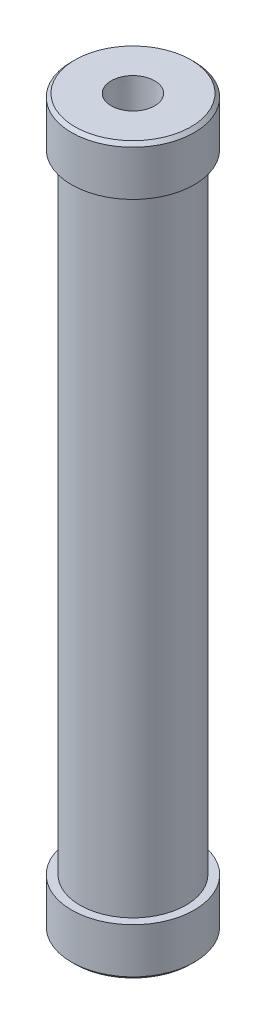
ISO-10303-21;
HEADER;
FILE_DESCRIPTION(('STEP AP214'),'2;1');
FILE_NAME('part.step','',(''),(''),'','','');
FILE_SCHEMA(('AUTOMOTIVE_DESIGN { 1 0 10303 214 1 1 1 1 }'));
ENDSEC;
DATA;
#1=APPLICATION_CONTEXT('core data for automotive mechanical design processes');
#2=APPLICATION_PROTOCOL_DEFINITION('international standard','automotive_design',2000,#1);
#3=PRODUCT_CONTEXT('',#1,'mechanical');
#4=PRODUCT('Part','Part','',(#3));
#5=PRODUCT_RELATED_PRODUCT_CATEGORY('part','',(#4));
#6=PRODUCT_DEFINITION_FORMATION('','',#4);
#7=PRODUCT_DEFINITION_CONTEXT('part definition',#1,'design');
#8=PRODUCT_DEFINITION('design','',#6,#7);
#9=PRODUCT_DEFINITION_SHAPE('','',#8);
#10=(LENGTH_UNIT() NAMED_UNIT(*) SI_UNIT(.MILLI.,.METRE.));
#11=(NAMED_UNIT(*) PLANE_ANGLE_UNIT() SI_UNIT($,.RADIAN.));
#12=(NAMED_UNIT(*) SI_UNIT($,.STERADIAN.) SOLID_ANGLE_UNIT());
#13=UNCERTAINTY_MEASURE_WITH_UNIT(LENGTH_MEASURE(1.E-05),#10,'distance_accuracy_value','');
#14=(GEOMETRIC_REPRESENTATION_CONTEXT(3) GLOBAL_UNCERTAINTY_ASSIGNED_CONTEXT((#13)) GLOBAL_UNIT_ASSIGNED_CONTEXT((#10,
#11,#12)) REPRESENTATION_CONTEXT('',''));
#15=CARTESIAN_POINT('',(0.,0.,0.));
#16=DIRECTION('',(0.,0.,1.));
#17=DIRECTION('',(1.,0.,0.));
#18=AXIS2_PLACEMENT_3D('',#15,#16,#17);
#19=CARTESIAN_POINT('',(0.,22.098,0.));
#20=DIRECTION('',(0.,1.,0.));
#21=DIRECTION('',(0.,0.,1.));
#22=AXIS2_PLACEMENT_3D('',#19,#20,#21);
#23=PLANE('',#22);
#24=CARTESIAN_POINT('',(0.,22.098,0.));
#25=DIRECTION('',(0.,1.,0.));
#26=DIRECTION('',(0.,0.,1.));
#27=AXIS2_PLACEMENT_3D('',#24,#25,#26);
#28=CIRCLE('',#27,8.75);
#29=CARTESIAN_POINT('',(0.,22.098,8.75));
#30=VERTEX_POINT('',#29);
#31=EDGE_CURVE('E54',#30,#30,#28,.T.);
#32=ORIENTED_EDGE('',*,*,#31,.F.);
#33=EDGE_LOOP('',(#32));
#34=FACE_BOUND('',#33,.T.);
#35=CARTESIAN_POINT('',(0.,22.098,0.));
#36=DIRECTION('',(0.,1.,0.));
#37=DIRECTION('',(0.,0.,1.));
#38=AXIS2_PLACEMENT_3D('',#35,#36,#37);
#39=CIRCLE('',#38,20.32);
#40=CARTESIAN_POINT('',(0.,22.098,20.32));
#41=VERTEX_POINT('',#40);
#42=EDGE_CURVE('E68',#41,#41,#39,.T.);
#43=ORIENTED_EDGE('',*,*,#42,.T.);
#44=EDGE_LOOP('',(#43));
#45=FACE_BOUND('',#44,.T.);
#46=ADVANCED_FACE('F33',(#34,#45),#23,.T.);
#47=CARTESIAN_POINT('',(0.,330.2,0.));
#48=DIRECTION('',(0.,-1.,0.));
#49=DIRECTION('',(0.,0.,-1.));
#50=AXIS2_PLACEMENT_3D('',#47,#48,#49);
#51=CYLINDRICAL_SURFACE('',#50,20.32);
#52=ORIENTED_EDGE('',*,*,#42,.F.);
#53=EDGE_LOOP('',(#52));
#54=FACE_BOUND('',#53,.T.);
#55=CARTESIAN_POINT('',(0.,308.102,0.));
#56=DIRECTION('',(0.,1.,0.));
#57=DIRECTION('',(0.,0.,1.));
#58=AXIS2_PLACEMENT_3D('',#55,#56,#57);
#59=CIRCLE('',#58,20.32);
#60=CARTESIAN_POINT('',(0.,308.102,20.32));
#61=VERTEX_POINT('',#60);
#62=EDGE_CURVE('E64',#61,#61,#59,.T.);
#63=ORIENTED_EDGE('',*,*,#62,.T.);
#64=EDGE_LOOP('',(#63));
#65=FACE_BOUND('',#64,.T.);
#66=ADVANCED_FACE('F118',(#54,#65),#51,.F.);
#67=CARTESIAN_POINT('',(0.,308.102,0.));
#68=DIRECTION('',(0.,1.,0.));
#69=DIRECTION('',(0.,0.,1.));
#70=AXIS2_PLACEMENT_3D('',#67,#68,#69);
#71=PLANE('',#70);
#72=CARTESIAN_POINT('',(0.,308.102,0.));
#73=DIRECTION('',(0.,1.,0.));
#74=DIRECTION('',(0.,0.,1.));
#75=AXIS2_PLACEMENT_3D('',#72,#73,#74);
#76=CIRCLE('',#75,8.75);
#77=CARTESIAN_POINT('',(0.,308.102,8.75));
#78=VERTEX_POINT('',#77);
#79=EDGE_CURVE('E59',#78,#78,#76,.T.);
#80=ORIENTED_EDGE('',*,*,#79,.T.);
#81=EDGE_LOOP('',(#80));
#82=FACE_BOUND('',#81,.T.);
#83=ORIENTED_EDGE('',*,*,#62,.F.);
#84=EDGE_LOOP('',(#83));
#85=FACE_BOUND('',#84,.T.);
#86=ADVANCED_FACE('F111',(#82,#85),#71,.F.);
#87=CARTESIAN_POINT('',(0.,330.2,0.));
#88=DIRECTION('',(0.,1.,0.));
#89=DIRECTION('',(0.,0.,1.));
#90=AXIS2_PLACEMENT_3D('',#87,#88,#89);
#91=CYLINDRICAL_SURFACE('',#90,8.75);
#92=CARTESIAN_POINT('',(0.,315.214,0.));
#93=DIRECTION('',(0.,1.,0.));
#94=DIRECTION('',(0.,0.,1.));
#95=AXIS2_PLACEMENT_3D('',#92,#93,#94);
#96=CIRCLE('',#95,8.75);
#97=CARTESIAN_POINT('',(0.,315.214,8.75));
#98=VERTEX_POINT('',#97);
#99=EDGE_CURVE('E63',#98,#98,#96,.T.);
#100=ORIENTED_EDGE('',*,*,#99,.T.);
#101=EDGE_LOOP('',(#100));
#102=FACE_BOUND('',#101,.T.);
#103=ORIENTED_EDGE('',*,*,#79,.F.);
#104=EDGE_LOOP('',(#103));
#105=FACE_BOUND('',#104,.T.);
#106=ADVANCED_FACE('F178',(#102,#105),#91,.F.);
#107=CARTESIAN_POINT('',(8.75,315.214,0.));
#108=DIRECTION('',(0.,-1.,0.));
#109=DIRECTION('',(0.,0.,-1.));
#110=AXIS2_PLACEMENT_3D('',#107,#108,#109);
#111=PLANE('',#110);
#112=ORIENTED_EDGE('',*,*,#99,.F.);
#113=EDGE_LOOP('',(#112));
#114=FACE_BOUND('',#113,.T.);
#115=CARTESIAN_POINT('',(0.,315.214,0.));
#116=DIRECTION('',(0.,1.,0.));
#117=DIRECTION('',(0.,0.,1.));
#118=AXIS2_PLACEMENT_3D('',#115,#116,#117);
#119=CIRCLE('',#118,9.42825071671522);
#120=CARTESIAN_POINT('',(0.,315.214,9.42825071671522));
#121=VERTEX_POINT('',#120);
#122=EDGE_CURVE('E82',#121,#121,#119,.T.);
#123=ORIENTED_EDGE('',*,*,#122,.T.);
#124=EDGE_LOOP('',(#123));
#125=FACE_BOUND('',#124,.T.);
#126=ADVANCED_FACE('F147',(#114,#125),#111,.F.);
#127=CARTESIAN_POINT('',(0.,330.2,0.));
#128=DIRECTION('',(0.,1.,0.));
#129=DIRECTION('',(0.,0.,1.));
#130=AXIS2_PLACEMENT_3D('',#127,#128,#129);
#131=CONICAL_SURFACE('',#130,9.896063,0.0312064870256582);
#132=ORIENTED_EDGE('',*,*,#122,.F.);
#133=EDGE_LOOP('',(#132));
#134=FACE_BOUND('',#133,.T.);
#135=CARTESIAN_POINT('',(0.,330.2,0.));
#136=DIRECTION('',(0.,1.,0.));
#137=DIRECTION('',(0.,0.,1.));
#138=AXIS2_PLACEMENT_3D('',#135,#136,#137);
#139=CIRCLE('',#138,9.896063);
#140=CARTESIAN_POINT('',(0.,330.2,9.896063));
#141=VERTEX_POINT('',#140);
#142=EDGE_CURVE('E57',#141,#141,#139,.T.);
#143=ORIENTED_EDGE('',*,*,#142,.T.);
#144=EDGE_LOOP('',(#143));
#145=FACE_BOUND('',#144,.T.);
#146=ADVANCED_FACE('F135',(#134,#145),#131,.F.);
#147=CARTESIAN_POINT('',(0.,330.2,0.));
#148=DIRECTION('',(0.,-1.,0.));
#149=DIRECTION('',(0.,0.,-1.));
#150=AXIS2_PLACEMENT_3D('',#147,#148,#149);
#151=CYLINDRICAL_SURFACE('',#150,24.13);
#152=CARTESIAN_POINT('',(0.,22.098,0.));
#153=DIRECTION('',(0.,1.,0.));
#154=DIRECTION('',(0.,0.,1.));
#155=AXIS2_PLACEMENT_3D('',#152,#153,#154);
#156=CIRCLE('',#155,24.13);
#157=CARTESIAN_POINT('',(0.,22.098,24.13));
#158=VERTEX_POINT('',#157);
#159=EDGE_CURVE('E71',#158,#158,#156,.T.);
#160=ORIENTED_EDGE('',*,*,#159,.T.);
#161=EDGE_LOOP('',(#160));
#162=FACE_BOUND('',#161,.T.);
#163=CARTESIAN_POINT('',(0.,308.102,0.));
#164=DIRECTION('',(0.,1.,0.));
#165=DIRECTION('',(0.,0.,1.));
#166=AXIS2_PLACEMENT_3D('',#163,#164,#165);
#167=CIRCLE('',#166,24.13);
#168=CARTESIAN_POINT('',(0.,308.102,24.13));
#169=VERTEX_POINT('',#168);
#170=EDGE_CURVE('E53',#169,#169,#167,.T.);
#171=ORIENTED_EDGE('',*,*,#170,.F.);
#172=EDGE_LOOP('',(#171));
#173=FACE_BOUND('',#172,.T.);
#174=ADVANCED_FACE('F130',(#162,#173),#151,.T.);
#175=CARTESIAN_POINT('',(0.,22.098,0.));
#176=DIRECTION('',(0.,1.,0.));
#177=DIRECTION('',(0.,0.,1.));
#178=AXIS2_PLACEMENT_3D('',#175,#176,#177);
#179=CIRCLE('',#178,27.94);
#180=CARTESIAN_POINT('',(0.,22.098,27.94));
#181=VERTEX_POINT('',#180);
#182=EDGE_CURVE('E67',#181,#181,#179,.T.);
#183=ORIENTED_EDGE('',*,*,#182,.T.);
#184=EDGE_LOOP('',(#183));
#185=FACE_BOUND('',#184,.T.);
#186=ORIENTED_EDGE('',*,*,#159,.F.);
#187=EDGE_LOOP('',(#186));
#188=FACE_BOUND('',#187,.T.);
#189=ADVANCED_FACE('F112',(#185,#188),#23,.T.);
#190=CARTESIAN_POINT('',(0.,22.098,0.));
#191=DIRECTION('',(0.,-1.,0.));
#192=DIRECTION('',(0.,0.,-1.));
#193=AXIS2_PLACEMENT_3D('',#190,#191,#192);
#194=CYLINDRICAL_SURFACE('',#193,27.94);
#195=CARTESIAN_POINT('',(0.,1.52400000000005,0.));
#196=DIRECTION('',(0.,1.,0.));
#197=DIRECTION('',(0.,0.,1.));
#198=AXIS2_PLACEMENT_3D('',#195,#196,#197);
#199=CIRCLE('',#198,27.94);
#200=CARTESIAN_POINT('',(0.,1.52400000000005,27.94));
#201=VERTEX_POINT('',#200);
#202=EDGE_CURVE('E48',#201,#201,#199,.T.);
#203=ORIENTED_EDGE('',*,*,#202,.T.);
#204=EDGE_LOOP('',(#203));
#205=FACE_BOUND('',#204,.T.);
#206=ORIENTED_EDGE('',*,*,#182,.F.);
#207=EDGE_LOOP('',(#206));
#208=FACE_BOUND('',#207,.T.);
#209=ADVANCED_FACE('F101',(#205,#208),#194,.T.);
#210=CARTESIAN_POINT('',(0.,0.,0.));
#211=DIRECTION('',(0.,1.,0.));
#212=DIRECTION('',(0.,0.,1.));
#213=AXIS2_PLACEMENT_3D('',#210,#211,#212);
#214=PLANE('',#213);
#215=CARTESIAN_POINT('',(0.,0.,0.));
#216=DIRECTION('',(0.,1.,0.));
#217=DIRECTION('',(0.,0.,1.));
#218=AXIS2_PLACEMENT_3D('',#215,#216,#217);
#219=CIRCLE('',#218,26.416);
#220=CARTESIAN_POINT('',(0.,0.,26.416));
#221=VERTEX_POINT('',#220);
#222=EDGE_CURVE('E44',#221,#221,#219,.F.);
#223=ORIENTED_EDGE('',*,*,#222,.T.);
#224=EDGE_LOOP('',(#223));
#225=FACE_BOUND('',#224,.T.);
#226=CARTESIAN_POINT('',(0.,0.,0.));
#227=DIRECTION('',(0.,-1.,0.));
#228=DIRECTION('',(0.,0.,-1.));
#229=AXIS2_PLACEMENT_3D('',#226,#227,#228);
#230=CIRCLE('',#229,9.896063);
#231=CARTESIAN_POINT('',(0.,0.,-9.896063));
#232=VERTEX_POINT('',#231);
#233=EDGE_CURVE('E92',#232,#232,#230,.T.);
#234=ORIENTED_EDGE('',*,*,#233,.F.);
#235=EDGE_LOOP('',(#234));
#236=FACE_BOUND('',#235,.T.);
#237=ADVANCED_FACE('F98',(#225,#236),#214,.F.);
#238=CARTESIAN_POINT('',(0.,308.102,0.));
#239=DIRECTION('',(0.,1.,0.));
#240=DIRECTION('',(0.,0.,1.));
#241=AXIS2_PLACEMENT_3D('',#238,#239,#240);
#242=CIRCLE('',#241,27.94);
#243=CARTESIAN_POINT('',(0.,308.102,27.94));
#244=VERTEX_POINT('',#243);
#245=EDGE_CURVE('E62',#244,#244,#242,.T.);
#246=ORIENTED_EDGE('',*,*,#245,.F.);
#247=EDGE_LOOP('',(#246));
#248=FACE_BOUND('',#247,.T.);
#249=ORIENTED_EDGE('',*,*,#170,.T.);
#250=EDGE_LOOP('',(#249));
#251=FACE_BOUND('',#250,.T.);
#252=ADVANCED_FACE('F100',(#248,#251),#71,.F.);
#253=CARTESIAN_POINT('',(0.,308.102,0.));
#254=DIRECTION('',(0.,1.,0.));
#255=DIRECTION('',(0.,0.,1.));
#256=AXIS2_PLACEMENT_3D('',#253,#254,#255);
#257=CYLINDRICAL_SURFACE('',#256,27.94);
#258=CARTESIAN_POINT('',(0.,328.676,0.));
#259=DIRECTION('',(0.,1.,0.));
#260=DIRECTION('',(0.,0.,1.));
#261=AXIS2_PLACEMENT_3D('',#258,#259,#260);
#262=CIRCLE('',#261,27.94);
#263=CARTESIAN_POINT('',(0.,328.676,-27.94));
#264=VERTEX_POINT('',#263);
#265=EDGE_CURVE('E10',#264,#264,#262,.F.);
#266=ORIENTED_EDGE('',*,*,#265,.T.);
#267=EDGE_LOOP('',(#266));
#268=FACE_BOUND('',#267,.T.);
#269=ORIENTED_EDGE('',*,*,#245,.T.);
#270=EDGE_LOOP('',(#269));
#271=FACE_BOUND('',#270,.T.);
#272=ADVANCED_FACE('F108',(#268,#271),#257,.T.);
#273=CARTESIAN_POINT('',(0.,330.2,0.));
#274=DIRECTION('',(0.,1.,0.));
#275=DIRECTION('',(0.,0.,1.));
#276=AXIS2_PLACEMENT_3D('',#273,#274,#275);
#277=PLANE('',#276);
#278=CARTESIAN_POINT('',(0.,330.2,0.));
#279=DIRECTION('',(0.,1.,0.));
#280=DIRECTION('',(0.,0.,1.));
#281=AXIS2_PLACEMENT_3D('',#278,#279,#280);
#282=CIRCLE('',#281,26.4159999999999);
#283=CARTESIAN_POINT('',(0.,330.2,-26.416));
#284=VERTEX_POINT('',#283);
#285=EDGE_CURVE('E40',#284,#284,#282,.T.);
#286=ORIENTED_EDGE('',*,*,#285,.T.);
#287=EDGE_LOOP('',(#286));
#288=FACE_BOUND('',#287,.T.);
#289=ORIENTED_EDGE('',*,*,#142,.F.);
#290=EDGE_LOOP('',(#289));
#291=FACE_BOUND('',#290,.T.);
#292=ADVANCED_FACE('F173',(#288,#291),#277,.T.);
#293=CARTESIAN_POINT('',(0.,0.,0.));
#294=DIRECTION('',(0.,-1.,0.));
#295=DIRECTION('',(0.,0.,-1.));
#296=AXIS2_PLACEMENT_3D('',#293,#294,#295);
#297=CYLINDRICAL_SURFACE('',#296,8.75);
#298=ORIENTED_EDGE('',*,*,#31,.T.);
#299=EDGE_LOOP('',(#298));
#300=FACE_BOUND('',#299,.T.);
#301=CARTESIAN_POINT('',(0.,14.986,0.));
#302=DIRECTION('',(0.,-1.,0.));
#303=DIRECTION('',(0.,0.,-1.));
#304=AXIS2_PLACEMENT_3D('',#301,#302,#303);
#305=CIRCLE('',#304,8.75);
#306=CARTESIAN_POINT('',(0.,14.986,-8.75));
#307=VERTEX_POINT('',#306);
#308=EDGE_CURVE('E58',#307,#307,#305,.T.);
#309=ORIENTED_EDGE('',*,*,#308,.T.);
#310=EDGE_LOOP('',(#309));
#311=FACE_BOUND('',#310,.T.);
#312=ADVANCED_FACE('F167',(#300,#311),#297,.F.);
#313=CARTESIAN_POINT('',(8.75,14.986,0.));
#314=DIRECTION('',(0.,1.,0.));
#315=DIRECTION('',(0.,0.,1.));
#316=AXIS2_PLACEMENT_3D('',#313,#314,#315);
#317=PLANE('',#316);
#318=ORIENTED_EDGE('',*,*,#308,.F.);
#319=EDGE_LOOP('',(#318));
#320=FACE_BOUND('',#319,.T.);
#321=CARTESIAN_POINT('',(0.,14.986,0.));
#322=DIRECTION('',(0.,-1.,0.));
#323=DIRECTION('',(0.,0.,-1.));
#324=AXIS2_PLACEMENT_3D('',#321,#322,#323);
#325=CIRCLE('',#324,9.42825071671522);
#326=CARTESIAN_POINT('',(0.,14.986,-9.42825071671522));
#327=VERTEX_POINT('',#326);
#328=EDGE_CURVE('E89',#327,#327,#325,.T.);
#329=ORIENTED_EDGE('',*,*,#328,.T.);
#330=EDGE_LOOP('',(#329));
#331=FACE_BOUND('',#330,.T.);
#332=ADVANCED_FACE('F158',(#320,#331),#317,.F.);
#333=CARTESIAN_POINT('',(0.,0.,0.));
#334=DIRECTION('',(0.,-1.,0.));
#335=DIRECTION('',(0.,0.,-1.));
#336=AXIS2_PLACEMENT_3D('',#333,#334,#335);
#337=CONICAL_SURFACE('',#336,9.896063,0.0312064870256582);
#338=ORIENTED_EDGE('',*,*,#328,.F.);
#339=EDGE_LOOP('',(#338));
#340=FACE_BOUND('',#339,.T.);
#341=ORIENTED_EDGE('',*,*,#233,.T.);
#342=EDGE_LOOP('',(#341));
#343=FACE_BOUND('',#342,.T.);
#344=ADVANCED_FACE('F96',(#340,#343),#337,.F.);
#345=CARTESIAN_POINT('',(0.,1.52400000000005,0.));
#346=DIRECTION('',(0.,1.,0.));
#347=DIRECTION('',(0.,0.,1.));
#348=AXIS2_PLACEMENT_3D('',#345,#346,#347);
#349=CONICAL_SURFACE('',#348,27.94,0.785398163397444);
#350=CARTESIAN_POINT('',(0.,0.,26.416));
#351=CARTESIAN_POINT('',(0.,0.0158749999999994,26.431875));
#352=CARTESIAN_POINT('',(0.,0.0317500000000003,26.44775));
#353=CARTESIAN_POINT('',(0.,0.063500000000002,26.4795));
#354=CARTESIAN_POINT('',(0.,0.0793750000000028,26.495375));
#355=CARTESIAN_POINT('',(0.,0.111125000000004,26.527125));
#356=CARTESIAN_POINT('',(0.,0.127000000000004,26.543));
#357=CARTESIAN_POINT('',(0.,0.158750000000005,26.57475));
#358=CARTESIAN_POINT('',(0.,0.174625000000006,26.590625));
#359=CARTESIAN_POINT('',(0.,0.206375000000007,26.622375));
#360=CARTESIAN_POINT('',(0.,0.222250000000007,26.63825));
#361=CARTESIAN_POINT('',(0.,0.254000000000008,26.67));
#362=CARTESIAN_POINT('',(0.,0.269875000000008,26.685875));
#363=CARTESIAN_POINT('',(0.,0.30162500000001,26.717625));
#364=CARTESIAN_POINT('',(0.,0.317500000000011,26.7335));
#365=CARTESIAN_POINT('',(0.,0.349250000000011,26.76525));
#366=CARTESIAN_POINT('',(0.,0.365125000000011,26.781125));
#367=CARTESIAN_POINT('',(0.,0.396875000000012,26.812875));
#368=CARTESIAN_POINT('',(0.,0.412750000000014,26.82875));
#369=CARTESIAN_POINT('',(0.,0.444500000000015,26.8605));
#370=CARTESIAN_POINT('',(0.,0.460375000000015,26.876375));
#371=CARTESIAN_POINT('',(0.,0.492125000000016,26.908125));
#372=CARTESIAN_POINT('',(0.,0.508000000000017,26.924));
#373=CARTESIAN_POINT('',(0.,0.539750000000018,26.95575));
#374=CARTESIAN_POINT('',(0.,0.555625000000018,26.971625));
#375=CARTESIAN_POINT('',(0.,0.587375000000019,27.003375));
#376=CARTESIAN_POINT('',(0.,0.603250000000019,27.01925));
#377=CARTESIAN_POINT('',(0.,0.63500000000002,27.051));
#378=CARTESIAN_POINT('',(0.,0.650875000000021,27.066875));
#379=CARTESIAN_POINT('',(0.,0.682625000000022,27.098625));
#380=CARTESIAN_POINT('',(0.,0.698500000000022,27.1145));
#381=CARTESIAN_POINT('',(0.,0.730250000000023,27.14625));
#382=CARTESIAN_POINT('',(0.,0.746125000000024,27.162125));
#383=CARTESIAN_POINT('',(0.,0.777875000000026,27.193875));
#384=CARTESIAN_POINT('',(0.,0.793750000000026,27.20975));
#385=CARTESIAN_POINT('',(0.,0.825500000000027,27.2415));
#386=CARTESIAN_POINT('',(0.,0.841375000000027,27.257375));
#387=CARTESIAN_POINT('',(0.,0.873125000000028,27.289125));
#388=CARTESIAN_POINT('',(0.,0.889000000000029,27.305));
#389=CARTESIAN_POINT('',(0.,0.92075000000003,27.33675));
#390=CARTESIAN_POINT('',(0.,0.93662500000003,27.352625));
#391=CARTESIAN_POINT('',(0.,0.968375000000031,27.384375));
#392=CARTESIAN_POINT('',(0.,0.984250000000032,27.40025));
#393=CARTESIAN_POINT('',(0.,1.01600000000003,27.432));
#394=CARTESIAN_POINT('',(0.,1.03187500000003,27.447875));
#395=CARTESIAN_POINT('',(0.,1.06362500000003,27.479625));
#396=CARTESIAN_POINT('',(0.,1.07950000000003,27.4955));
#397=CARTESIAN_POINT('',(0.,1.11125000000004,27.52725));
#398=CARTESIAN_POINT('',(0.,1.12712500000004,27.543125));
#399=CARTESIAN_POINT('',(0.,1.15887500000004,27.574875));
#400=CARTESIAN_POINT('',(0.,1.17475000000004,27.59075));
#401=CARTESIAN_POINT('',(0.,1.20650000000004,27.6225));
#402=CARTESIAN_POINT('',(0.,1.22237500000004,27.638375));
#403=CARTESIAN_POINT('',(0.,1.25412500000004,27.670125));
#404=CARTESIAN_POINT('',(0.,1.27000000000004,27.686));
#405=CARTESIAN_POINT('',(0.,1.30175000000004,27.71775));
#406=CARTESIAN_POINT('',(0.,1.31762500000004,27.733625));
#407=CARTESIAN_POINT('',(0.,1.34937500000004,27.765375));
#408=CARTESIAN_POINT('',(0.,1.36525000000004,27.78125));
#409=CARTESIAN_POINT('',(0.,1.39700000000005,27.813));
#410=CARTESIAN_POINT('',(0.,1.41287500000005,27.828875));
#411=CARTESIAN_POINT('',(0.,1.44462500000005,27.860625));
#412=CARTESIAN_POINT('',(0.,1.46050000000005,27.8765));
#413=CARTESIAN_POINT('',(0.,1.49225000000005,27.90825));
#414=CARTESIAN_POINT('',(0.,1.50812500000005,27.924125));
#415=CARTESIAN_POINT('',(0.,1.52400000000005,27.94));
#416=B_SPLINE_CURVE_WITH_KNOTS('',3,(#350,#351,#352,#353,#354,#355,#356,#357,#358,#359,#360,
#361,#362,#363,#364,#365,#366,#367,#368,#369,#370,#371,#372,#373,#374,#375,#376,#377,#378,#379,
#380,#381,#382,#383,#384,#385,#386,#387,#388,#389,#390,#391,#392,#393,#394,#395,#396,#397,#398,
#399,#400,#401,#402,#403,#404,#405,#406,#407,#408,#409,#410,#411,#412,#413,#414,#415),
.UNSPECIFIED.,.F.,.F.,(4,2,2,2,2,2,2,2,2,2,2,2,2,2,2,2,2,2,2,2,2,2,2,2,2,2,2,2,2,2,2,2,4),(0.,
0.0673519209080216,0.134703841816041,0.202055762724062,0.269407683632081,0.336759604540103,
0.404111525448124,0.471463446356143,0.538815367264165,0.606167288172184,0.673519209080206,
0.740871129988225,0.808223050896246,0.875574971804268,0.942926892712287,1.01027881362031,
1.07763073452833,1.14498265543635,1.21233457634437,1.27968649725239,1.34703841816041,
1.41439033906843,1.48174225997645,1.54909418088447,1.61644610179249,1.68379802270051,
1.75114994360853,1.81850186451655,1.88585378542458,1.95320570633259,2.02055762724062,
2.08790954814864,2.15526146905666),.UNSPECIFIED.);
#417=EDGE_CURVE('BSEAM150',#221,#201,#416,.T.);
#418=ORIENTED_EDGE('',*,*,#222,.F.);
#419=ORIENTED_EDGE('',*,*,#202,.F.);
#420=ORIENTED_EDGE('',*,*,#417,.T.);
#421=ORIENTED_EDGE('',*,*,#417,.F.);
#422=EDGE_LOOP('',(#418,#420,#419,#421));
#423=FACE_BOUND('',#422,.T.);
#424=ADVANCED_FACE('F150',(#423),#349,.T.);
#425=CARTESIAN_POINT('',(0.,330.2,0.));
#426=DIRECTION('',(0.,-1.,0.));
#427=DIRECTION('',(0.,0.,-1.));
#428=AXIS2_PLACEMENT_3D('',#425,#426,#427);
#429=CONICAL_SURFACE('',#428,26.4159999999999,0.785398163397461);
#430=CARTESIAN_POINT('',(0.,328.676,-27.94));
#431=CARTESIAN_POINT('',(0.,328.691875,-27.924125));
#432=CARTESIAN_POINT('',(0.,328.70775,-27.90825));
#433=CARTESIAN_POINT('',(0.,328.7395,-27.8765));
#434=CARTESIAN_POINT('',(0.,328.755375,-27.860625));
#435=CARTESIAN_POINT('',(0.,328.787125,-27.828875));
#436=CARTESIAN_POINT('',(0.,328.803,-27.813));
#437=CARTESIAN_POINT('',(0.,328.83475,-27.78125));
#438=CARTESIAN_POINT('',(0.,328.850625,-27.765375));
#439=CARTESIAN_POINT('',(0.,328.882375,-27.733625));
#440=CARTESIAN_POINT('',(0.,328.89825,-27.71775));
#441=CARTESIAN_POINT('',(0.,328.93,-27.686));
#442=CARTESIAN_POINT('',(0.,328.945875,-27.670125));
#443=CARTESIAN_POINT('',(0.,328.977625,-27.638375));
#444=CARTESIAN_POINT('',(0.,328.9935,-27.6225));
#445=CARTESIAN_POINT('',(0.,329.02525,-27.59075));
#446=CARTESIAN_POINT('',(0.,329.041125,-27.574875));
#447=CARTESIAN_POINT('',(0.,329.072875,-27.543125));
#448=CARTESIAN_POINT('',(0.,329.08875,-27.52725));
#449=CARTESIAN_POINT('',(0.,329.1205,-27.4955));
#450=CARTESIAN_POINT('',(0.,329.136375,-27.479625));
#451=CARTESIAN_POINT('',(0.,329.168125,-27.447875));
#452=CARTESIAN_POINT('',(0.,329.184,-27.432));
#453=CARTESIAN_POINT('',(0.,329.21575,-27.40025));
#454=CARTESIAN_POINT('',(0.,329.231625,-27.384375));
#455=CARTESIAN_POINT('',(0.,329.263375,-27.352625));
#456=CARTESIAN_POINT('',(0.,329.27925,-27.33675));
#457=CARTESIAN_POINT('',(0.,329.311,-27.305));
#458=CARTESIAN_POINT('',(0.,329.326875,-27.289125));
#459=CARTESIAN_POINT('',(0.,329.358625,-27.257375));
#460=CARTESIAN_POINT('',(0.,329.3745,-27.2415));
#461=CARTESIAN_POINT('',(0.,329.40625,-27.20975));
#462=CARTESIAN_POINT('',(0.,329.422125,-27.193875));
#463=CARTESIAN_POINT('',(0.,329.453875,-27.162125));
#464=CARTESIAN_POINT('',(0.,329.46975,-27.14625));
#465=CARTESIAN_POINT('',(0.,329.5015,-27.1145));
#466=CARTESIAN_POINT('',(0.,329.517375,-27.098625));
#467=CARTESIAN_POINT('',(0.,329.549125,-27.066875));
#468=CARTESIAN_POINT('',(0.,329.565,-27.051));
#469=CARTESIAN_POINT('',(0.,329.59675,-27.01925));
#470=CARTESIAN_POINT('',(0.,329.612625,-27.003375));
#471=CARTESIAN_POINT('',(0.,329.644375,-26.971625));
#472=CARTESIAN_POINT('',(0.,329.66025,-26.95575));
#473=CARTESIAN_POINT('',(0.,329.692,-26.924));
#474=CARTESIAN_POINT('',(0.,329.707875,-26.908125));
#475=CARTESIAN_POINT('',(0.,329.739625,-26.876375));
#476=CARTESIAN_POINT('',(0.,329.7555,-26.8605));
#477=CARTESIAN_POINT('',(0.,329.78725,-26.82875));
#478=CARTESIAN_POINT('',(0.,329.803125,-26.812875));
#479=CARTESIAN_POINT('',(0.,329.834875,-26.781125));
#480=CARTESIAN_POINT('',(0.,329.85075,-26.76525));
#481=CARTESIAN_POINT('',(0.,329.8825,-26.7335));
#482=CARTESIAN_POINT('',(0.,329.898375,-26.717625));
#483=CARTESIAN_POINT('',(0.,329.930125,-26.685875));
#484=CARTESIAN_POINT('',(0.,329.946,-26.67));
#485=CARTESIAN_POINT('',(0.,329.97775,-26.63825));
#486=CARTESIAN_POINT('',(0.,329.993625,-26.622375));
#487=CARTESIAN_POINT('',(0.,330.025375,-26.590625));
#488=CARTESIAN_POINT('',(0.,330.04125,-26.57475));
#489=CARTESIAN_POINT('',(0.,330.073,-26.543));
#490=CARTESIAN_POINT('',(0.,330.088875,-26.527125));
#491=CARTESIAN_POINT('',(0.,330.120625,-26.495375));
#492=CARTESIAN_POINT('',(0.,330.1365,-26.4795));
#493=CARTESIAN_POINT('',(0.,330.16825,-26.44775));
#494=CARTESIAN_POINT('',(0.,330.184125,-26.431875));
#495=CARTESIAN_POINT('',(0.,330.2,-26.416));
#496=B_SPLINE_CURVE_WITH_KNOTS('',3,(#430,#431,#432,#433,#434,#435,#436,#437,#438,#439,#440,
#441,#442,#443,#444,#445,#446,#447,#448,#449,#450,#451,#452,#453,#454,#455,#456,#457,#458,#459,
#460,#461,#462,#463,#464,#465,#466,#467,#468,#469,#470,#471,#472,#473,#474,#475,#476,#477,#478,
#479,#480,#481,#482,#483,#484,#485,#486,#487,#488,#489,#490,#491,#492,#493,#494,#495),
.UNSPECIFIED.,.F.,.F.,(4,2,2,2,2,2,2,2,2,2,2,2,2,2,2,2,2,2,2,2,2,2,2,2,2,2,2,2,2,2,2,2,4),(0.,
0.0673519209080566,0.134703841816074,0.202055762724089,0.269407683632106,0.336759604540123,
0.404111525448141,0.471463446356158,0.538815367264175,0.606167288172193,0.673519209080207,
0.740871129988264,0.808223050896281,0.875574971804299,0.942926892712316,1.01027881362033,
1.07763073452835,1.14498265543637,1.21233457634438,1.2796864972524,1.34703841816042,
1.41439033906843,1.48174225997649,1.54909418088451,1.61644610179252,1.68379802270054,
1.75114994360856,1.81850186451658,1.88585378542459,1.95320570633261,2.02055762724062,
2.08790954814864,2.1552614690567),.UNSPECIFIED.);
#497=EDGE_CURVE('BSEAM35',#264,#284,#496,.T.);
#498=ORIENTED_EDGE('',*,*,#265,.F.);
#499=ORIENTED_EDGE('',*,*,#285,.F.);
#500=ORIENTED_EDGE('',*,*,#497,.T.);
#501=ORIENTED_EDGE('',*,*,#497,.F.);
#502=EDGE_LOOP('',(#498,#500,#499,#501));
#503=FACE_BOUND('',#502,.T.);
#504=ADVANCED_FACE('F35',(#503),#429,.T.);
#505=CLOSED_SHELL('',(#46,#66,#86,#106,#126,#146,#174,#189,#209,#237,#252,#272,#292,#312,#332,
#344,#424,#504));
#506=MANIFOLD_SOLID_BREP('B2',#505);
#507=ADVANCED_BREP_SHAPE_REPRESENTATION('',(#18,#506),#14);
#508=SHAPE_DEFINITION_REPRESENTATION(#9,#507);
ENDSEC;
END-ISO-10303-21;
